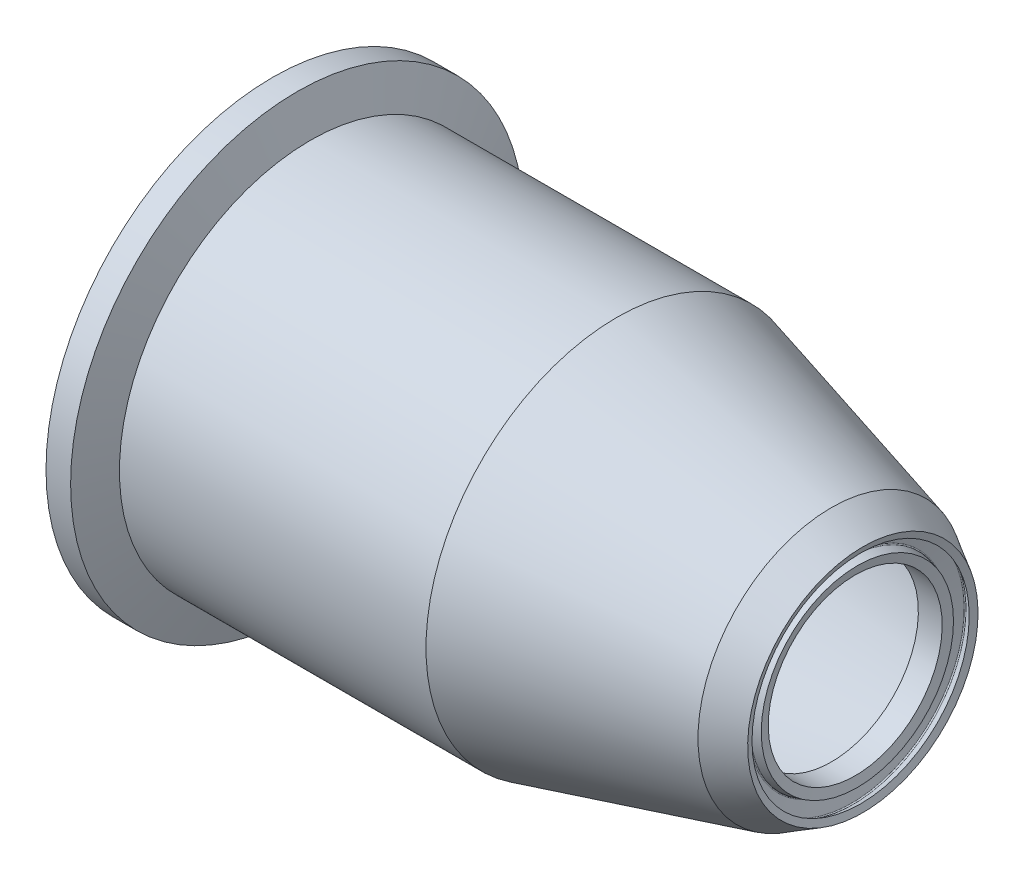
ISO-10303-21;
HEADER;
FILE_DESCRIPTION(('STEP AP214'),'2;1');
FILE_NAME('part.step','',(''),(''),'','','');
FILE_SCHEMA(('AUTOMOTIVE_DESIGN { 1 0 10303 214 1 1 1 1 }'));
ENDSEC;
DATA;
#1=APPLICATION_CONTEXT('core data for automotive mechanical design processes');
#2=APPLICATION_PROTOCOL_DEFINITION('international standard','automotive_design',2000,#1);
#3=PRODUCT_CONTEXT('',#1,'mechanical');
#4=PRODUCT('Part','Part','',(#3));
#5=PRODUCT_RELATED_PRODUCT_CATEGORY('part','',(#4));
#6=PRODUCT_DEFINITION_FORMATION('','',#4);
#7=PRODUCT_DEFINITION_CONTEXT('part definition',#1,'design');
#8=PRODUCT_DEFINITION('design','',#6,#7);
#9=PRODUCT_DEFINITION_SHAPE('','',#8);
#10=(LENGTH_UNIT() NAMED_UNIT(*) SI_UNIT(.MILLI.,.METRE.));
#11=(NAMED_UNIT(*) PLANE_ANGLE_UNIT() SI_UNIT($,.RADIAN.));
#12=(NAMED_UNIT(*) SI_UNIT($,.STERADIAN.) SOLID_ANGLE_UNIT());
#13=UNCERTAINTY_MEASURE_WITH_UNIT(LENGTH_MEASURE(1.E-05),#10,'distance_accuracy_value','');
#14=(GEOMETRIC_REPRESENTATION_CONTEXT(3) GLOBAL_UNCERTAINTY_ASSIGNED_CONTEXT((#13)) GLOBAL_UNIT_ASSIGNED_CONTEXT((#10,
#11,#12)) REPRESENTATION_CONTEXT('',''));
#15=CARTESIAN_POINT('',(0.,0.,0.));
#16=DIRECTION('',(0.,0.,1.));
#17=DIRECTION('',(1.,0.,0.));
#18=AXIS2_PLACEMENT_3D('',#15,#16,#17);
#19=CARTESIAN_POINT('',(-254.,60.325,3.18882766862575E-13));
#20=DIRECTION('',(-1.,0.,0.));
#21=DIRECTION('',(0.,-1.,0.));
#22=AXIS2_PLACEMENT_3D('',#19,#20,#21);
#23=PLANE('',#22);
#24=CARTESIAN_POINT('',(-254.,-1.5393367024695E-13,4.00926166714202E-13));
#25=DIRECTION('',(1.,0.,0.));
#26=DIRECTION('',(0.,1.,0.));
#27=AXIS2_PLACEMENT_3D('',#24,#25,#26);
#28=CIRCLE('',#27,55.6117031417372);
#29=CARTESIAN_POINT('',(-254.,55.611703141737,3.25292959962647E-13));
#30=VERTEX_POINT('',#29);
#31=EDGE_CURVE('E109',#30,#30,#28,.T.);
#32=ORIENTED_EDGE('',*,*,#31,.T.);
#33=EDGE_LOOP('',(#32));
#34=FACE_BOUND('',#33,.T.);
#35=CARTESIAN_POINT('',(-254.,-1.5393367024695E-13,4.00926166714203E-13));
#36=DIRECTION('',(1.,0.,0.));
#37=DIRECTION('',(0.,1.,0.));
#38=AXIS2_PLACEMENT_3D('',#35,#36,#37);
#39=CIRCLE('',#38,60.325);
#40=CARTESIAN_POINT('',(-254.,60.3249999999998,3.18882766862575E-13));
#41=VERTEX_POINT('',#40);
#42=EDGE_CURVE('E10',#41,#41,#39,.T.);
#43=ORIENTED_EDGE('',*,*,#42,.F.);
#44=EDGE_LOOP('',(#43));
#45=FACE_BOUND('',#44,.T.);
#46=ADVANCED_FACE('F30',(#34,#45),#23,.T.);
#47=CARTESIAN_POINT('',(0.,0.,0.));
#48=DIRECTION('',(1.,0.,0.));
#49=DIRECTION('',(0.,1.,0.));
#50=AXIS2_PLACEMENT_3D('',#47,#48,#49);
#51=CYLINDRICAL_SURFACE('',#50,60.325);
#52=ORIENTED_EDGE('',*,*,#42,.T.);
#53=EDGE_LOOP('',(#52));
#54=FACE_BOUND('',#53,.T.);
#55=CARTESIAN_POINT('',(-247.4468,-1.49962181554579E-13,3.90582271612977E-13));
#56=DIRECTION('',(1.,0.,0.));
#57=DIRECTION('',(0.,1.,0.));
#58=AXIS2_PLACEMENT_3D('',#55,#56,#57);
#59=CIRCLE('',#58,60.325);
#60=CARTESIAN_POINT('',(-247.4468,60.3249999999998,3.08538871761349E-13));
#61=VERTEX_POINT('',#60);
#62=EDGE_CURVE('E36',#61,#61,#59,.T.);
#63=ORIENTED_EDGE('',*,*,#62,.F.);
#64=EDGE_LOOP('',(#63));
#65=FACE_BOUND('',#64,.T.);
#66=ADVANCED_FACE('F127',(#54,#65),#51,.T.);
#67=CARTESIAN_POINT('',(-243.979983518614,-1.47861158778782E-13,3.85110076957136E-13));
#68=DIRECTION('',(-1.,0.,0.));
#69=DIRECTION('',(0.,-1.,0.));
#70=AXIS2_PLACEMENT_3D('',#67,#68,#69);
#71=CONICAL_SURFACE('',#70,50.8,1.22173047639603);
#72=ORIENTED_EDGE('',*,*,#62,.T.);
#73=EDGE_LOOP('',(#72));
#74=FACE_BOUND('',#73,.T.);
#75=CARTESIAN_POINT('',(-243.979983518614,-1.47861158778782E-13,3.85110076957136E-13));
#76=DIRECTION('',(1.,0.,0.));
#77=DIRECTION('',(0.,1.,0.));
#78=AXIS2_PLACEMENT_3D('',#75,#76,#77);
#79=CIRCLE('',#78,50.8);
#80=CARTESIAN_POINT('',(-243.979983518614,50.7999999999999,3.16020898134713E-13));
#81=VERTEX_POINT('',#80);
#82=EDGE_CURVE('E40',#81,#81,#79,.T.);
#83=ORIENTED_EDGE('',*,*,#82,.F.);
#84=EDGE_LOOP('',(#83));
#85=FACE_BOUND('',#84,.T.);
#86=ADVANCED_FACE('F131',(#74,#85),#71,.T.);
#87=CARTESIAN_POINT('',(0.,0.,0.));
#88=DIRECTION('',(1.,0.,0.));
#89=DIRECTION('',(0.,1.,0.));
#90=AXIS2_PLACEMENT_3D('',#87,#88,#89);
#91=CYLINDRICAL_SURFACE('',#90,50.8);
#92=ORIENTED_EDGE('',*,*,#82,.T.);
#93=EDGE_LOOP('',(#92));
#94=FACE_BOUND('',#93,.T.);
#95=CARTESIAN_POINT('',(-162.381972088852,0.,2.56311738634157E-13));
#96=DIRECTION('',(1.,0.,0.));
#97=DIRECTION('',(0.,1.,0.));
#98=AXIS2_PLACEMENT_3D('',#95,#96,#97);
#99=CIRCLE('',#98,50.8);
#100=CARTESIAN_POINT('',(-162.381972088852,50.7999999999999,1.87222559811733E-13));
#101=VERTEX_POINT('',#100);
#102=EDGE_CURVE('E44',#101,#101,#99,.T.);
#103=ORIENTED_EDGE('',*,*,#102,.F.);
#104=EDGE_LOOP('',(#103));
#105=FACE_BOUND('',#104,.T.);
#106=ADVANCED_FACE('F135',(#94,#105),#91,.T.);
#107=CARTESIAN_POINT('',(-105.280059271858,0.,1.66179254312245E-13));
#108=DIRECTION('',(-1.,0.,0.));
#109=DIRECTION('',(0.,-1.,0.));
#110=AXIS2_PLACEMENT_3D('',#107,#108,#109);
#111=CONICAL_SURFACE('',#110,35.4995885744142,0.26179938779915);
#112=ORIENTED_EDGE('',*,*,#102,.T.);
#113=EDGE_LOOP('',(#112));
#114=FACE_BOUND('',#113,.T.);
#115=CARTESIAN_POINT('',(-105.280059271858,0.,1.66179254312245E-13));
#116=DIRECTION('',(1.,0.,0.));
#117=DIRECTION('',(0.,1.,0.));
#118=AXIS2_PLACEMENT_3D('',#115,#116,#117);
#119=CIRCLE('',#118,35.4995885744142);
#120=CARTESIAN_POINT('',(-105.280059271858,35.4995885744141,1.17898990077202E-13));
#121=VERTEX_POINT('',#120);
#122=EDGE_CURVE('E49',#121,#121,#119,.T.);
#123=ORIENTED_EDGE('',*,*,#122,.F.);
#124=EDGE_LOOP('',(#123));
#125=FACE_BOUND('',#124,.T.);
#126=ADVANCED_FACE('F141',(#114,#125),#111,.T.);
#127=CARTESIAN_POINT('',(-96.8962445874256,0.,1.52945826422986E-13));
#128=DIRECTION('',(-1.,0.,0.));
#129=DIRECTION('',(0.,-1.,0.));
#130=AXIS2_PLACEMENT_3D('',#127,#128,#129);
#131=CONICAL_SURFACE('',#130,30.6591909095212,0.5235987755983);
#132=ORIENTED_EDGE('',*,*,#122,.T.);
#133=EDGE_LOOP('',(#132));
#134=FACE_BOUND('',#133,.T.);
#135=CARTESIAN_POINT('',(-96.8962445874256,0.,1.52945826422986E-13));
#136=DIRECTION('',(1.,0.,0.));
#137=DIRECTION('',(0.,1.,0.));
#138=AXIS2_PLACEMENT_3D('',#135,#136,#137);
#139=CIRCLE('',#138,30.6591909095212);
#140=CARTESIAN_POINT('',(-96.8962445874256,30.6591909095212,1.11248615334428E-13));
#141=VERTEX_POINT('',#140);
#142=EDGE_CURVE('E52',#141,#141,#139,.T.);
#143=ORIENTED_EDGE('',*,*,#142,.F.);
#144=EDGE_LOOP('',(#143));
#145=FACE_BOUND('',#144,.T.);
#146=ADVANCED_FACE('F145',(#134,#145),#131,.T.);
#147=CARTESIAN_POINT('',(-97.4972874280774,0.,1.53894542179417E-13));
#148=DIRECTION('',(1.,0.,0.));
#149=DIRECTION('',(0.,1.,0.));
#150=AXIS2_PLACEMENT_3D('',#147,#148,#149);
#151=CONICAL_SURFACE('',#150,28.9110715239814,1.23963538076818);
#152=ORIENTED_EDGE('',*,*,#142,.T.);
#153=EDGE_LOOP('',(#152));
#154=FACE_BOUND('',#153,.T.);
#155=CARTESIAN_POINT('',(-97.4972874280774,0.,1.53894542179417E-13));
#156=DIRECTION('',(1.,0.,0.));
#157=DIRECTION('',(0.,1.,0.));
#158=AXIS2_PLACEMENT_3D('',#155,#156,#157);
#159=CIRCLE('',#158,28.9110715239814);
#160=CARTESIAN_POINT('',(-97.4972874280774,28.9110715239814,1.14574814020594E-13));
#161=VERTEX_POINT('',#160);
#162=EDGE_CURVE('E55',#161,#161,#159,.T.);
#163=ORIENTED_EDGE('',*,*,#162,.F.);
#164=EDGE_LOOP('',(#163));
#165=FACE_BOUND('',#164,.T.);
#166=ADVANCED_FACE('F149',(#154,#165),#151,.F.);
#167=CARTESIAN_POINT('',(-99.4838969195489,0.,1.57030304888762E-13));
#168=DIRECTION('',(-1.,0.,0.));
#169=DIRECTION('',(0.,-1.,0.));
#170=AXIS2_PLACEMENT_3D('',#167,#168,#169);
#171=CONICAL_SURFACE('',#170,30.0580410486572,0.523598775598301);
#172=ORIENTED_EDGE('',*,*,#162,.T.);
#173=EDGE_LOOP('',(#172));
#174=FACE_BOUND('',#173,.T.);
#175=CARTESIAN_POINT('',(-99.4838969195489,0.,1.57030304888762E-13));
#176=DIRECTION('',(1.,0.,0.));
#177=DIRECTION('',(0.,1.,0.));
#178=AXIS2_PLACEMENT_3D('',#175,#176,#177);
#179=CIRCLE('',#178,30.0580410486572);
#180=CARTESIAN_POINT('',(-99.4838969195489,30.0580410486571,1.16150671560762E-13));
#181=VERTEX_POINT('',#180);
#182=EDGE_CURVE('E58',#181,#181,#179,.T.);
#183=ORIENTED_EDGE('',*,*,#182,.F.);
#184=EDGE_LOOP('',(#183));
#185=FACE_BOUND('',#184,.T.);
#186=ADVANCED_FACE('F153',(#174,#185),#171,.F.);
#187=CARTESIAN_POINT('',(-99.6108969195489,0.,1.57230767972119E-13));
#188=DIRECTION('',(1.,0.,0.));
#189=DIRECTION('',(0.,1.,0.));
#190=AXIS2_PLACEMENT_3D('',#187,#188,#189);
#191=TOROIDAL_SURFACE('',#190,29.8380705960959,0.254000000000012);
#192=ORIENTED_EDGE('',*,*,#182,.T.);
#193=EDGE_LOOP('',(#192));
#194=FACE_BOUND('',#193,.T.);
#195=CARTESIAN_POINT('',(-99.8562420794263,0.,1.57618032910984E-13));
#196=DIRECTION('',(1.,0.,0.));
#197=DIRECTION('',(0.,1.,0.));
#198=AXIS2_PLACEMENT_3D('',#195,#196,#197);
#199=CIRCLE('',#198,29.903810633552);
#200=CARTESIAN_POINT('',(-99.8562420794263,29.9038106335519,1.16948156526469E-13));
#201=VERTEX_POINT('',#200);
#202=EDGE_CURVE('E61',#201,#201,#199,.T.);
#203=ORIENTED_EDGE('',*,*,#202,.F.);
#204=EDGE_LOOP('',(#203));
#205=FACE_BOUND('',#204,.T.);
#206=ADVANCED_FACE('F157',(#194,#205),#191,.F.);
#207=CARTESIAN_POINT('',(-100.769816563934,0.,1.59060064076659E-13));
#208=DIRECTION('',(1.,0.,0.));
#209=DIRECTION('',(0.,1.,0.));
#210=AXIS2_PLACEMENT_3D('',#207,#208,#209);
#211=CONICAL_SURFACE('',#210,26.4943042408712,1.30899693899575);
#212=ORIENTED_EDGE('',*,*,#202,.T.);
#213=EDGE_LOOP('',(#212));
#214=FACE_BOUND('',#213,.T.);
#215=CARTESIAN_POINT('',(-100.769816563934,0.,1.59060064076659E-13));
#216=DIRECTION('',(1.,0.,0.));
#217=DIRECTION('',(0.,1.,0.));
#218=AXIS2_PLACEMENT_3D('',#215,#216,#217);
#219=CIRCLE('',#218,26.4943042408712);
#220=CARTESIAN_POINT('',(-100.769816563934,26.4943042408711,1.23027195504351E-13));
#221=VERTEX_POINT('',#220);
#222=EDGE_CURVE('E64',#221,#221,#219,.T.);
#223=ORIENTED_EDGE('',*,*,#222,.F.);
#224=EDGE_LOOP('',(#223));
#225=FACE_BOUND('',#224,.T.);
#226=ADVANCED_FACE('F161',(#214,#225),#211,.F.);
#227=CARTESIAN_POINT('',(-100.524471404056,0.,1.58672799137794E-13));
#228=DIRECTION('',(1.,0.,0.));
#229=DIRECTION('',(0.,1.,0.));
#230=AXIS2_PLACEMENT_3D('',#227,#228,#229);
#231=TOROIDAL_SURFACE('',#230,26.4285642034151,0.254000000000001);
#232=ORIENTED_EDGE('',*,*,#222,.T.);
#233=EDGE_LOOP('',(#232));
#234=FACE_BOUND('',#233,.T.);
#235=CARTESIAN_POINT('',(-100.590211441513,0.,1.5877656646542E-13));
#236=DIRECTION('',(1.,0.,0.));
#237=DIRECTION('',(0.,1.,0.));
#238=AXIS2_PLACEMENT_3D('',#235,#236,#237);
#239=CIRCLE('',#238,26.1832190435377);
#240=CARTESIAN_POINT('',(-100.590211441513,26.1832190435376,1.23166780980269E-13));
#241=VERTEX_POINT('',#240);
#242=EDGE_CURVE('E67',#241,#241,#239,.T.);
#243=ORIENTED_EDGE('',*,*,#242,.F.);
#244=EDGE_LOOP('',(#243));
#245=FACE_BOUND('',#244,.T.);
#246=ADVANCED_FACE('F165',(#234,#245),#231,.F.);
#247=CARTESIAN_POINT('',(-98.357570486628,0.,1.55252455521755E-13));
#248=DIRECTION('',(-1.,0.,0.));
#249=DIRECTION('',(0.,-1.,0.));
#250=AXIS2_PLACEMENT_3D('',#247,#248,#249);
#251=CONICAL_SURFACE('',#250,25.5849847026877,0.26179938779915);
#252=ORIENTED_EDGE('',*,*,#242,.T.);
#253=EDGE_LOOP('',(#252));
#254=FACE_BOUND('',#253,.T.);
#255=CARTESIAN_POINT('',(-98.357570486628,0.,1.55252455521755E-13));
#256=DIRECTION('',(1.,0.,0.));
#257=DIRECTION('',(0.,1.,0.));
#258=AXIS2_PLACEMENT_3D('',#255,#256,#257);
#259=CIRCLE('',#258,25.5849847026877);
#260=CARTESIAN_POINT('',(-98.3575704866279,25.5849847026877,1.20456282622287E-13));
#261=VERTEX_POINT('',#260);
#262=EDGE_CURVE('E70',#261,#261,#259,.T.);
#263=ORIENTED_EDGE('',*,*,#262,.F.);
#264=EDGE_LOOP('',(#263));
#265=FACE_BOUND('',#264,.T.);
#266=ADVANCED_FACE('F169',(#254,#265),#251,.T.);
#267=CARTESIAN_POINT('',(-98.9269440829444,0.,1.56151182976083E-13));
#268=DIRECTION('',(1.,0.,0.));
#269=DIRECTION('',(0.,1.,0.));
#270=AXIS2_PLACEMENT_3D('',#267,#268,#269);
#271=CONICAL_SURFACE('',#270,23.1521,1.34090162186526);
#272=ORIENTED_EDGE('',*,*,#262,.T.);
#273=EDGE_LOOP('',(#272));
#274=FACE_BOUND('',#273,.T.);
#275=CARTESIAN_POINT('',(-98.9269440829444,0.,1.56151182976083E-13));
#276=DIRECTION('',(1.,0.,0.));
#277=DIRECTION('',(0.,1.,0.));
#278=AXIS2_PLACEMENT_3D('',#275,#276,#277);
#279=CIRCLE('',#278,23.1521);
#280=CARTESIAN_POINT('',(-98.9269440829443,23.1520999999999,1.24663789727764E-13));
#281=VERTEX_POINT('',#280);
#282=EDGE_CURVE('E73',#281,#281,#279,.T.);
#283=ORIENTED_EDGE('',*,*,#282,.F.);
#284=EDGE_LOOP('',(#283));
#285=FACE_BOUND('',#284,.T.);
#286=ADVANCED_FACE('F173',(#274,#285),#271,.F.);
#287=CARTESIAN_POINT('',(0.,0.,0.));
#288=DIRECTION('',(1.,0.,0.));
#289=DIRECTION('',(0.,1.,0.));
#290=AXIS2_PLACEMENT_3D('',#287,#288,#289);
#291=CYLINDRICAL_SURFACE('',#290,23.1521);
#292=ORIENTED_EDGE('',*,*,#282,.T.);
#293=EDGE_LOOP('',(#292));
#294=FACE_BOUND('',#293,.T.);
#295=CARTESIAN_POINT('',(-105.276944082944,0.,1.66174337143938E-13));
#296=DIRECTION('',(1.,0.,0.));
#297=DIRECTION('',(0.,1.,0.));
#298=AXIS2_PLACEMENT_3D('',#295,#296,#297);
#299=CIRCLE('',#298,23.1521);
#300=CARTESIAN_POINT('',(-105.276944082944,23.1520999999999,1.34686943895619E-13));
#301=VERTEX_POINT('',#300);
#302=EDGE_CURVE('E76',#301,#301,#299,.T.);
#303=ORIENTED_EDGE('',*,*,#302,.F.);
#304=EDGE_LOOP('',(#303));
#305=FACE_BOUND('',#304,.T.);
#306=ADVANCED_FACE('F177',(#294,#305),#291,.F.);
#307=CARTESIAN_POINT('',(-105.276944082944,23.1521,1.34686943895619E-13));
#308=DIRECTION('',(-1.,0.,0.));
#309=DIRECTION('',(0.,-1.,0.));
#310=AXIS2_PLACEMENT_3D('',#307,#308,#309);
#311=PLANE('',#310);
#312=ORIENTED_EDGE('',*,*,#302,.T.);
#313=EDGE_LOOP('',(#312));
#314=FACE_BOUND('',#313,.T.);
#315=CARTESIAN_POINT('',(-105.276944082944,0.,1.66174337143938E-13));
#316=DIRECTION('',(1.,0.,0.));
#317=DIRECTION('',(0.,1.,0.));
#318=AXIS2_PLACEMENT_3D('',#315,#316,#317);
#319=CIRCLE('',#318,32.2117519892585);
#320=CARTESIAN_POINT('',(-105.276944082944,32.2117519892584,1.22365606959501E-13));
#321=VERTEX_POINT('',#320);
#322=EDGE_CURVE('E79',#321,#321,#319,.T.);
#323=ORIENTED_EDGE('',*,*,#322,.F.);
#324=EDGE_LOOP('',(#323));
#325=FACE_BOUND('',#324,.T.);
#326=ADVANCED_FACE('F181',(#314,#325),#311,.T.);
#327=CARTESIAN_POINT('',(-162.799968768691,0.,2.56971525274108E-13));
#328=DIRECTION('',(-1.,0.,0.));
#329=DIRECTION('',(0.,-1.,0.));
#330=AXIS2_PLACEMENT_3D('',#327,#328,#329);
#331=CONICAL_SURFACE('',#330,47.625,0.26179938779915);
#332=ORIENTED_EDGE('',*,*,#322,.T.);
#333=EDGE_LOOP('',(#332));
#334=FACE_BOUND('',#333,.T.);
#335=CARTESIAN_POINT('',(-162.799968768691,0.,2.56971525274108E-13));
#336=DIRECTION('',(1.,0.,0.));
#337=DIRECTION('',(0.,1.,0.));
#338=AXIS2_PLACEMENT_3D('',#335,#336,#337);
#339=CIRCLE('',#338,47.625);
#340=CARTESIAN_POINT('',(-162.799968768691,47.6249999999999,1.92200420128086E-13));
#341=VERTEX_POINT('',#340);
#342=EDGE_CURVE('E82',#341,#341,#339,.T.);
#343=ORIENTED_EDGE('',*,*,#342,.F.);
#344=EDGE_LOOP('',(#343));
#345=FACE_BOUND('',#344,.T.);
#346=ADVANCED_FACE('F185',(#334,#345),#331,.F.);
#347=CARTESIAN_POINT('',(0.,0.,0.));
#348=DIRECTION('',(1.,0.,0.));
#349=DIRECTION('',(0.,1.,0.));
#350=AXIS2_PLACEMENT_3D('',#347,#348,#349);
#351=CYLINDRICAL_SURFACE('',#350,47.625);
#352=ORIENTED_EDGE('',*,*,#342,.T.);
#353=EDGE_LOOP('',(#352));
#354=FACE_BOUND('',#353,.T.);
#355=CARTESIAN_POINT('',(-256.3876,-1.55380646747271E-13,4.04694872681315E-13));
#356=DIRECTION('',(1.,0.,0.));
#357=DIRECTION('',(0.,1.,0.));
#358=AXIS2_PLACEMENT_3D('',#355,#356,#357);
#359=CIRCLE('',#358,47.625);
#360=CARTESIAN_POINT('',(-256.3876,47.6249999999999,3.39923767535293E-13));
#361=VERTEX_POINT('',#360);
#362=EDGE_CURVE('E85',#361,#361,#359,.T.);
#363=ORIENTED_EDGE('',*,*,#362,.F.);
#364=EDGE_LOOP('',(#363));
#365=FACE_BOUND('',#364,.T.);
#366=ADVANCED_FACE('F189',(#354,#365),#351,.F.);
#367=CARTESIAN_POINT('',(-256.3876,50.927,3.35432970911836E-13));
#368=DIRECTION('',(-1.,0.,0.));
#369=DIRECTION('',(0.,-1.,0.));
#370=AXIS2_PLACEMENT_3D('',#367,#368,#369);
#371=PLANE('',#370);
#372=ORIENTED_EDGE('',*,*,#362,.T.);
#373=EDGE_LOOP('',(#372));
#374=FACE_BOUND('',#373,.T.);
#375=CARTESIAN_POINT('',(-256.3876,-1.55380646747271E-13,4.04694872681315E-13));
#376=DIRECTION('',(1.,0.,0.));
#377=DIRECTION('',(0.,1.,0.));
#378=AXIS2_PLACEMENT_3D('',#375,#376,#377);
#379=CIRCLE('',#378,50.927);
#380=CARTESIAN_POINT('',(-256.3876,50.9269999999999,3.35432970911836E-13));
#381=VERTEX_POINT('',#380);
#382=EDGE_CURVE('E88',#381,#381,#379,.T.);
#383=ORIENTED_EDGE('',*,*,#382,.F.);
#384=EDGE_LOOP('',(#383));
#385=FACE_BOUND('',#384,.T.);
#386=ADVANCED_FACE('F193',(#374,#385),#371,.T.);
#387=CARTESIAN_POINT('',(0.,0.,0.));
#388=DIRECTION('',(1.,0.,0.));
#389=DIRECTION('',(0.,1.,0.));
#390=AXIS2_PLACEMENT_3D('',#387,#388,#389);
#391=CYLINDRICAL_SURFACE('',#390,50.927);
#392=ORIENTED_EDGE('',*,*,#382,.T.);
#393=EDGE_LOOP('',(#392));
#394=FACE_BOUND('',#393,.T.);
#395=CARTESIAN_POINT('',(-254.,-1.5393367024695E-13,4.00926166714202E-13));
#396=DIRECTION('',(1.,0.,0.));
#397=DIRECTION('',(0.,1.,0.));
#398=AXIS2_PLACEMENT_3D('',#395,#396,#397);
#399=CIRCLE('',#398,50.927);
#400=CARTESIAN_POINT('',(-254.,50.9269999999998,3.31664264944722E-13));
#401=VERTEX_POINT('',#400);
#402=EDGE_CURVE('E91',#401,#401,#399,.T.);
#403=ORIENTED_EDGE('',*,*,#402,.F.);
#404=EDGE_LOOP('',(#403));
#405=FACE_BOUND('',#404,.T.);
#406=ADVANCED_FACE('F197',(#394,#405),#391,.T.);
#407=CARTESIAN_POINT('',(-254.,50.927,3.31664264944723E-13));
#408=DIRECTION('',(-1.,0.,0.));
#409=DIRECTION('',(0.,-1.,0.));
#410=AXIS2_PLACEMENT_3D('',#407,#408,#409);
#411=PLANE('',#410);
#412=ORIENTED_EDGE('',*,*,#402,.T.);
#413=EDGE_LOOP('',(#412));
#414=FACE_BOUND('',#413,.T.);
#415=CARTESIAN_POINT('',(-254.,-1.5393367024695E-13,4.00926166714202E-13));
#416=DIRECTION('',(1.,0.,0.));
#417=DIRECTION('',(0.,1.,0.));
#418=AXIS2_PLACEMENT_3D('',#415,#416,#417);
#419=CIRCLE('',#418,52.1843);
#420=CARTESIAN_POINT('',(-254.,52.1842999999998,3.29954307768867E-13));
#421=VERTEX_POINT('',#420);
#422=EDGE_CURVE('E94',#421,#421,#419,.T.);
#423=ORIENTED_EDGE('',*,*,#422,.F.);
#424=EDGE_LOOP('',(#423));
#425=FACE_BOUND('',#424,.T.);
#426=ADVANCED_FACE('F201',(#414,#425),#411,.T.);
#427=CARTESIAN_POINT('',(0.,0.,0.));
#428=DIRECTION('',(1.,0.,0.));
#429=DIRECTION('',(0.,1.,0.));
#430=AXIS2_PLACEMENT_3D('',#427,#428,#429);
#431=CYLINDRICAL_SURFACE('',#430,52.1843);
#432=ORIENTED_EDGE('',*,*,#422,.T.);
#433=EDGE_LOOP('',(#432));
#434=FACE_BOUND('',#433,.T.);
#435=CARTESIAN_POINT('',(-251.6886,-1.52532873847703E-13,3.97277738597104E-13));
#436=DIRECTION('',(1.,0.,0.));
#437=DIRECTION('',(0.,1.,0.));
#438=AXIS2_PLACEMENT_3D('',#435,#436,#437);
#439=CIRCLE('',#438,52.1843);
#440=CARTESIAN_POINT('',(-251.6886,52.1842999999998,3.26305879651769E-13));
#441=VERTEX_POINT('',#440);
#442=EDGE_CURVE('E97',#441,#441,#439,.T.);
#443=ORIENTED_EDGE('',*,*,#442,.F.);
#444=EDGE_LOOP('',(#443));
#445=FACE_BOUND('',#444,.T.);
#446=ADVANCED_FACE('F205',(#434,#445),#431,.T.);
#447=CARTESIAN_POINT('',(-251.6886,-1.49466503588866E-13,3.97277738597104E-13));
#448=DIRECTION('',(1.,0.,0.));
#449=DIRECTION('',(0.,1.,0.));
#450=AXIS2_PLACEMENT_3D('',#447,#448,#449);
#451=TOROIDAL_SURFACE('',#450,52.4383,0.253999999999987);
#452=ORIENTED_EDGE('',*,*,#442,.T.);
#453=EDGE_LOOP('',(#452));
#454=FACE_BOUND('',#453,.T.);
#455=CARTESIAN_POINT('',(-251.4346,-1.52378940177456E-13,3.96876812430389E-13));
#456=DIRECTION('',(1.,0.,0.));
#457=DIRECTION('',(0.,1.,0.));
#458=AXIS2_PLACEMENT_3D('',#455,#456,#457);
#459=CIRCLE('',#458,52.4383);
#460=CARTESIAN_POINT('',(-251.4346,52.4382999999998,3.25559507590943E-13));
#461=VERTEX_POINT('',#460);
#462=EDGE_CURVE('E100',#461,#461,#459,.T.);
#463=ORIENTED_EDGE('',*,*,#462,.F.);
#464=EDGE_LOOP('',(#463));
#465=FACE_BOUND('',#464,.T.);
#466=ADVANCED_FACE('F209',(#454,#465),#451,.F.);
#467=CARTESIAN_POINT('',(-251.4346,55.9680807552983,3.20758923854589E-13));
#468=DIRECTION('',(-1.,0.,0.));
#469=DIRECTION('',(0.,-1.,0.));
#470=AXIS2_PLACEMENT_3D('',#467,#468,#469);
#471=PLANE('',#470);
#472=ORIENTED_EDGE('',*,*,#462,.T.);
#473=EDGE_LOOP('',(#472));
#474=FACE_BOUND('',#473,.T.);
#475=CARTESIAN_POINT('',(-251.4346,-1.52378940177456E-13,3.96876812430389E-13));
#476=DIRECTION('',(1.,0.,0.));
#477=DIRECTION('',(0.,1.,0.));
#478=AXIS2_PLACEMENT_3D('',#475,#476,#477);
#479=CIRCLE('',#478,55.9680807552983);
#480=CARTESIAN_POINT('',(-251.4346,55.9680807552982,3.20758923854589E-13));
#481=VERTEX_POINT('',#480);
#482=EDGE_CURVE('E103',#481,#481,#479,.T.);
#483=ORIENTED_EDGE('',*,*,#482,.F.);
#484=EDGE_LOOP('',(#483));
#485=FACE_BOUND('',#484,.T.);
#486=ADVANCED_FACE('F123',(#474,#485),#471,.T.);
#487=CARTESIAN_POINT('',(-251.6886,-1.49466503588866E-13,3.97277738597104E-13));
#488=DIRECTION('',(1.,0.,0.));
#489=DIRECTION('',(0.,1.,0.));
#490=AXIS2_PLACEMENT_3D('',#487,#488,#489);
#491=TOROIDAL_SURFACE('',#490,55.9680807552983,0.254000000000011);
#492=ORIENTED_EDGE('',*,*,#482,.T.);
#493=EDGE_LOOP('',(#492));
#494=FACE_BOUND('',#493,.T.);
#495=CARTESIAN_POINT('',(-251.754340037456,-1.52572714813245E-13,3.9738150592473E-13));
#496=DIRECTION('',(1.,0.,0.));
#497=DIRECTION('',(0.,1.,0.));
#498=AXIS2_PLACEMENT_3D('',#495,#496,#497);
#499=CIRCLE('',#498,56.2134259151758);
#500=CARTESIAN_POINT('',(-251.754340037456,56.2134259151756,3.20929942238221E-13));
#501=VERTEX_POINT('',#500);
#502=EDGE_CURVE('E106',#501,#501,#499,.T.);
#503=ORIENTED_EDGE('',*,*,#502,.F.);
#504=EDGE_LOOP('',(#503));
#505=FACE_BOUND('',#504,.T.);
#506=ADVANCED_FACE('F117',(#494,#505),#491,.F.);
#507=CARTESIAN_POINT('',(-254.,-1.5393367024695E-13,4.00926166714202E-13));
#508=DIRECTION('',(1.,0.,0.));
#509=DIRECTION('',(0.,1.,0.));
#510=AXIS2_PLACEMENT_3D('',#507,#508,#509);
#511=CONICAL_SURFACE('',#510,55.6117031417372,0.261799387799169);
#512=ORIENTED_EDGE('',*,*,#502,.T.);
#513=EDGE_LOOP('',(#512));
#514=FACE_BOUND('',#513,.T.);
#515=ORIENTED_EDGE('',*,*,#31,.F.);
#516=EDGE_LOOP('',(#515));
#517=FACE_BOUND('',#516,.T.);
#518=ADVANCED_FACE('F115',(#514,#517),#511,.F.);
#519=CLOSED_SHELL('',(#46,#66,#86,#106,#126,#146,#166,#186,#206,#226,#246,#266,#286,#306,#326,
#346,#366,#386,#406,#426,#446,#466,#486,#506,#518));
#520=MANIFOLD_SOLID_BREP('B2',#519);
#521=ADVANCED_BREP_SHAPE_REPRESENTATION('',(#18,#520),#14);
#522=SHAPE_DEFINITION_REPRESENTATION(#9,#521);
ENDSEC;
END-ISO-10303-21;
